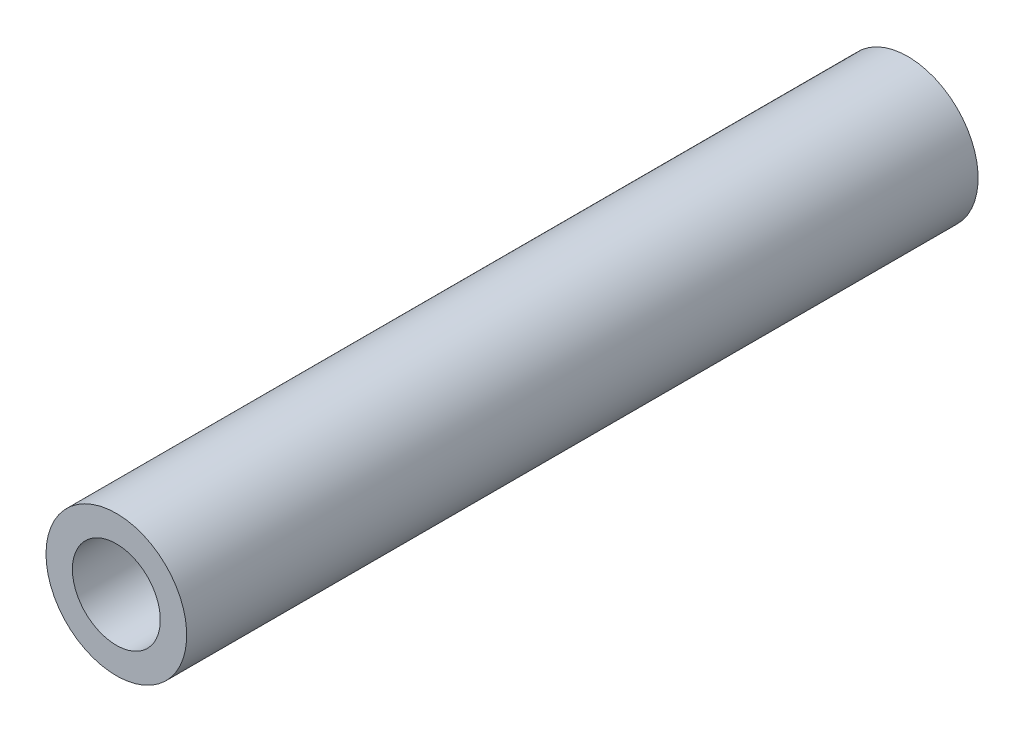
from build123d import *

# Parameters (mm, degrees)
ESQUISSE1_R          = 4
ESQUISSE1_R_2        = 2.5
BASE_EXTRUSION_DEPTH = 45


with BuildPart() as part:
    # Esquisse1 → Base-Extrusion (new body)
    with BuildSketch(Plane.XY):
        with Locations(Location((0, 0, 0), (0, 0, 180))):
            Circle(ESQUISSE1_R)
        with Locations(Location((0, 0, 0), (0, 0, 180))):
            Circle(ESQUISSE1_R_2, mode=Mode.SUBTRACT)
    extrude(amount=BASE_EXTRUSION_DEPTH)


solid = part.part
